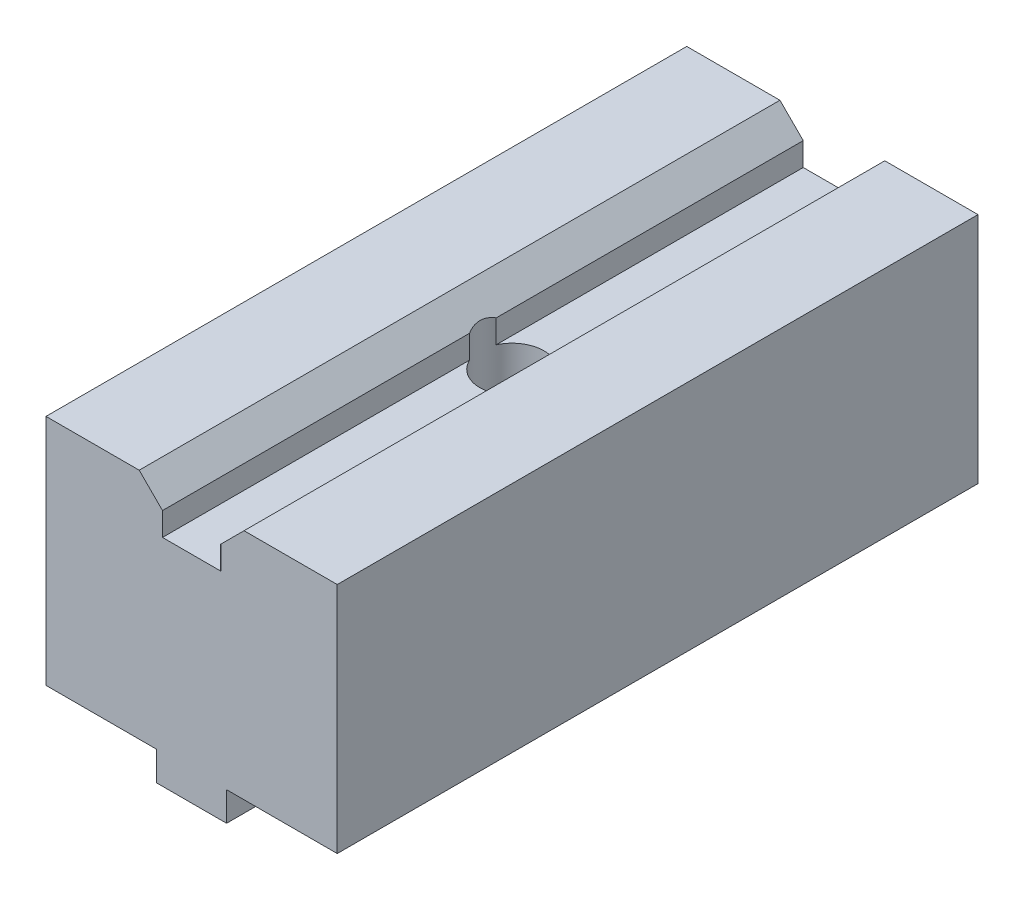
ISO-10303-21;
HEADER;
FILE_DESCRIPTION(('STEP AP214'),'2;1');
FILE_NAME('part.step','',(''),(''),'','','');
FILE_SCHEMA(('AUTOMOTIVE_DESIGN { 1 0 10303 214 1 1 1 1 }'));
ENDSEC;
DATA;
#1=APPLICATION_CONTEXT('core data for automotive mechanical design processes');
#2=APPLICATION_PROTOCOL_DEFINITION('international standard','automotive_design',2000,#1);
#3=PRODUCT_CONTEXT('',#1,'mechanical');
#4=PRODUCT('Part','Part','',(#3));
#5=PRODUCT_RELATED_PRODUCT_CATEGORY('part','',(#4));
#6=PRODUCT_DEFINITION_FORMATION('','',#4);
#7=PRODUCT_DEFINITION_CONTEXT('part definition',#1,'design');
#8=PRODUCT_DEFINITION('design','',#6,#7);
#9=PRODUCT_DEFINITION_SHAPE('','',#8);
#10=(LENGTH_UNIT() NAMED_UNIT(*) SI_UNIT(.MILLI.,.METRE.));
#11=(NAMED_UNIT(*) PLANE_ANGLE_UNIT() SI_UNIT($,.RADIAN.));
#12=(NAMED_UNIT(*) SI_UNIT($,.STERADIAN.) SOLID_ANGLE_UNIT());
#13=UNCERTAINTY_MEASURE_WITH_UNIT(LENGTH_MEASURE(1.E-05),#10,'distance_accuracy_value','');
#14=(GEOMETRIC_REPRESENTATION_CONTEXT(3) GLOBAL_UNCERTAINTY_ASSIGNED_CONTEXT((#13)) GLOBAL_UNIT_ASSIGNED_CONTEXT((#10,
#11,#12)) REPRESENTATION_CONTEXT('',''));
#15=CARTESIAN_POINT('',(0.,0.,0.));
#16=DIRECTION('',(0.,0.,1.));
#17=DIRECTION('',(1.,0.,0.));
#18=AXIS2_PLACEMENT_3D('',#15,#16,#17);
#19=CARTESIAN_POINT('',(2.5,4.53219844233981,27.5));
#20=DIRECTION('',(1.,0.,0.));
#21=DIRECTION('',(0.,1.,0.));
#22=AXIS2_PLACEMENT_3D('',#19,#20,#21);
#23=PLANE('',#22);
#24=DIRECTION('',(0.,0.,-1.));
#25=VECTOR('',#24,1.);
#26=CARTESIAN_POINT('',(2.5,2.53219844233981,27.5));
#27=LINE('',#26,#25);
#28=CARTESIAN_POINT('',(2.5,2.53219844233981,-1.14564392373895));
#29=VERTEX_POINT('',#28);
#30=CARTESIAN_POINT('',(2.5,2.53219844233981,-27.5));
#31=VERTEX_POINT('',#30);
#32=EDGE_CURVE('E406',#29,#31,#27,.T.);
#33=ORIENTED_EDGE('',*,*,#32,.F.);
#34=DIRECTION('',(0.,1.,0.));
#35=VECTOR('',#34,1.);
#36=CARTESIAN_POINT('',(2.5,6.53219844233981,-1.14564392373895));
#37=LINE('',#36,#35);
#38=CARTESIAN_POINT('',(2.5,4.53219844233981,-1.14564392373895));
#39=VERTEX_POINT('',#38);
#40=EDGE_CURVE('E176',#29,#39,#37,.T.);
#41=ORIENTED_EDGE('',*,*,#40,.T.);
#42=DIRECTION('',(0.,0.,-1.));
#43=VECTOR('',#42,1.);
#44=CARTESIAN_POINT('',(2.5,4.53219844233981,27.5));
#45=LINE('',#44,#43);
#46=CARTESIAN_POINT('',(2.5,4.53219844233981,-27.5));
#47=VERTEX_POINT('',#46);
#48=EDGE_CURVE('E412',#39,#47,#45,.T.);
#49=ORIENTED_EDGE('',*,*,#48,.T.);
#50=DIRECTION('',(0.,-1.,0.));
#51=VECTOR('',#50,1.);
#52=CARTESIAN_POINT('',(2.5,4.53219844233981,-27.5));
#53=LINE('',#52,#51);
#54=EDGE_CURVE('E384',#47,#31,#53,.T.);
#55=ORIENTED_EDGE('',*,*,#54,.T.);
#56=EDGE_LOOP('',(#33,#41,#49,#55));
#57=FACE_BOUND('',#56,.T.);
#58=ADVANCED_FACE('F39',(#57),#23,.F.);
#59=CARTESIAN_POINT('',(-2.5,2.53219844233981,27.5));
#60=DIRECTION('',(0.,-1.,0.));
#61=DIRECTION('',(0.,0.,-1.));
#62=AXIS2_PLACEMENT_3D('',#59,#60,#61);
#63=PLANE('',#62);
#64=CARTESIAN_POINT('',(2.5,2.53219844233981,27.5));
#65=VERTEX_POINT('',#64);
#66=CARTESIAN_POINT('',(2.5,2.53219844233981,1.14564392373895));
#67=VERTEX_POINT('',#66);
#68=EDGE_CURVE('E407',#65,#67,#27,.T.);
#69=ORIENTED_EDGE('',*,*,#68,.T.);
#70=CARTESIAN_POINT('',(0.,2.53219844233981,0.));
#71=DIRECTION('',(0.,-1.,0.));
#72=DIRECTION('',(0.,0.,-1.));
#73=AXIS2_PLACEMENT_3D('',#70,#71,#72);
#74=CIRCLE('',#73,2.75);
#75=CARTESIAN_POINT('',(-2.5,2.53219844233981,1.14564392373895));
#76=VERTEX_POINT('',#75);
#77=EDGE_CURVE('E212',#67,#76,#74,.T.);
#78=ORIENTED_EDGE('',*,*,#77,.T.);
#79=DIRECTION('',(0.,0.,-1.));
#80=VECTOR('',#79,1.);
#81=CARTESIAN_POINT('',(-2.5,2.53219844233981,27.5));
#82=LINE('',#81,#80);
#83=CARTESIAN_POINT('',(-2.5,2.53219844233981,27.5));
#84=VERTEX_POINT('',#83);
#85=EDGE_CURVE('E175',#84,#76,#82,.T.);
#86=ORIENTED_EDGE('',*,*,#85,.F.);
#87=DIRECTION('',(-1.,0.,0.));
#88=VECTOR('',#87,1.);
#89=CARTESIAN_POINT('',(-2.5,2.53219844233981,27.5));
#90=LINE('',#89,#88);
#91=EDGE_CURVE('E368',#65,#84,#90,.T.);
#92=ORIENTED_EDGE('',*,*,#91,.F.);
#93=EDGE_LOOP('',(#69,#78,#86,#92));
#94=FACE_BOUND('',#93,.T.);
#95=ADVANCED_FACE('F405',(#94),#63,.F.);
#96=CARTESIAN_POINT('',(-2.5,4.53219844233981,27.5));
#97=DIRECTION('',(-1.,0.,0.));
#98=DIRECTION('',(0.,-1.,0.));
#99=AXIS2_PLACEMENT_3D('',#96,#97,#98);
#100=PLANE('',#99);
#101=ORIENTED_EDGE('',*,*,#85,.T.);
#102=DIRECTION('',(0.,1.,0.));
#103=VECTOR('',#102,1.);
#104=CARTESIAN_POINT('',(-2.5,6.53219844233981,1.14564392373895));
#105=LINE('',#104,#103);
#106=CARTESIAN_POINT('',(-2.5,4.53219844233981,1.14564392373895));
#107=VERTEX_POINT('',#106);
#108=EDGE_CURVE('E162',#76,#107,#105,.T.);
#109=ORIENTED_EDGE('',*,*,#108,.T.);
#110=DIRECTION('',(0.,0.,-1.));
#111=VECTOR('',#110,1.);
#112=CARTESIAN_POINT('',(-2.5,4.53219844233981,27.5));
#113=LINE('',#112,#111);
#114=CARTESIAN_POINT('',(-2.5,4.53219844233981,27.5));
#115=VERTEX_POINT('',#114);
#116=EDGE_CURVE('E172',#115,#107,#113,.T.);
#117=ORIENTED_EDGE('',*,*,#116,.F.);
#118=DIRECTION('',(0.,1.,0.));
#119=VECTOR('',#118,1.);
#120=CARTESIAN_POINT('',(-2.5,4.53219844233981,27.5));
#121=LINE('',#120,#119);
#122=EDGE_CURVE('E372',#84,#115,#121,.T.);
#123=ORIENTED_EDGE('',*,*,#122,.F.);
#124=EDGE_LOOP('',(#101,#109,#117,#123));
#125=FACE_BOUND('',#124,.T.);
#126=ADVANCED_FACE('F170',(#125),#100,.F.);
#127=CARTESIAN_POINT('',(12.5,-13.4678015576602,27.5));
#128=DIRECTION('',(0.,1.,0.));
#129=DIRECTION('',(0.,0.,1.));
#130=AXIS2_PLACEMENT_3D('',#127,#128,#129);
#131=PLANE('',#130);
#132=DIRECTION('',(0.,0.,1.));
#133=VECTOR('',#132,1.);
#134=CARTESIAN_POINT('',(3.,-13.4678015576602,-27.5));
#135=LINE('',#134,#133);
#136=CARTESIAN_POINT('',(3.,-13.4678015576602,-27.5));
#137=VERTEX_POINT('',#136);
#138=CARTESIAN_POINT('',(3.,-13.4678015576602,27.5));
#139=VERTEX_POINT('',#138);
#140=EDGE_CURVE('E273',#137,#139,#135,.T.);
#141=ORIENTED_EDGE('',*,*,#140,.F.);
#142=DIRECTION('',(1.,0.,0.));
#143=VECTOR('',#142,1.);
#144=CARTESIAN_POINT('',(12.5,-13.4678015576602,-27.5));
#145=LINE('',#144,#143);
#146=CARTESIAN_POINT('',(12.5,-13.4678015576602,-27.5));
#147=VERTEX_POINT('',#146);
#148=EDGE_CURVE('E250',#137,#147,#145,.T.);
#149=ORIENTED_EDGE('',*,*,#148,.T.);
#150=DIRECTION('',(0.,0.,-1.));
#151=VECTOR('',#150,1.);
#152=CARTESIAN_POINT('',(12.5,-13.4678015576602,27.5));
#153=LINE('',#152,#151);
#154=CARTESIAN_POINT('',(12.5,-13.4678015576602,27.5));
#155=VERTEX_POINT('',#154);
#156=EDGE_CURVE('E263',#155,#147,#153,.T.);
#157=ORIENTED_EDGE('',*,*,#156,.F.);
#158=DIRECTION('',(1.,0.,0.));
#159=VECTOR('',#158,1.);
#160=CARTESIAN_POINT('',(12.5,-13.4678015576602,27.5));
#161=LINE('',#160,#159);
#162=EDGE_CURVE('E317',#139,#155,#161,.T.);
#163=ORIENTED_EDGE('',*,*,#162,.F.);
#164=EDGE_LOOP('',(#141,#149,#157,#163));
#165=FACE_BOUND('',#164,.T.);
#166=ADVANCED_FACE('F348',(#165),#131,.F.);
#167=CARTESIAN_POINT('',(-12.5,-13.4678015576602,27.5));
#168=DIRECTION('',(1.,0.,0.));
#169=DIRECTION('',(0.,1.,0.));
#170=AXIS2_PLACEMENT_3D('',#167,#168,#169);
#171=PLANE('',#170);
#172=DIRECTION('',(0.,-1.,0.));
#173=VECTOR('',#172,1.);
#174=CARTESIAN_POINT('',(-12.5,-13.4678015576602,-27.5));
#175=LINE('',#174,#173);
#176=CARTESIAN_POINT('',(-12.5,6.53219844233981,-27.5));
#177=VERTEX_POINT('',#176);
#178=CARTESIAN_POINT('',(-12.5,-13.4678015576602,-27.5));
#179=VERTEX_POINT('',#178);
#180=EDGE_CURVE('E243',#177,#179,#175,.T.);
#181=ORIENTED_EDGE('',*,*,#180,.T.);
#182=DIRECTION('',(0.,0.,-1.));
#183=VECTOR('',#182,1.);
#184=CARTESIAN_POINT('',(-12.5,-13.4678015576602,27.5));
#185=LINE('',#184,#183);
#186=CARTESIAN_POINT('',(-12.5,-13.4678015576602,27.5));
#187=VERTEX_POINT('',#186);
#188=EDGE_CURVE('E47',#187,#179,#185,.T.);
#189=ORIENTED_EDGE('',*,*,#188,.F.);
#190=DIRECTION('',(0.,-1.,0.));
#191=VECTOR('',#190,1.);
#192=CARTESIAN_POINT('',(-12.5,-13.4678015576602,27.5));
#193=LINE('',#192,#191);
#194=CARTESIAN_POINT('',(-12.5,6.53219844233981,27.5));
#195=VERTEX_POINT('',#194);
#196=EDGE_CURVE('E324',#195,#187,#193,.T.);
#197=ORIENTED_EDGE('',*,*,#196,.F.);
#198=DIRECTION('',(0.,0.,-1.));
#199=VECTOR('',#198,1.);
#200=CARTESIAN_POINT('',(-12.5,6.53219844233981,27.5));
#201=LINE('',#200,#199);
#202=EDGE_CURVE('E390',#195,#177,#201,.T.);
#203=ORIENTED_EDGE('',*,*,#202,.T.);
#204=EDGE_LOOP('',(#181,#189,#197,#203));
#205=FACE_BOUND('',#204,.T.);
#206=ADVANCED_FACE('F41',(#205),#171,.F.);
#207=CARTESIAN_POINT('',(-3.,-13.4678015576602,-27.5));
#208=VERTEX_POINT('',#207);
#209=EDGE_CURVE('E255',#179,#208,#145,.T.);
#210=ORIENTED_EDGE('',*,*,#209,.T.);
#211=DIRECTION('',(0.,0.,1.));
#212=VECTOR('',#211,1.);
#213=CARTESIAN_POINT('',(-3.,-13.4678015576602,-27.5));
#214=LINE('',#213,#212);
#215=CARTESIAN_POINT('',(-3.,-13.4678015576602,27.5));
#216=VERTEX_POINT('',#215);
#217=EDGE_CURVE('E280',#208,#216,#214,.T.);
#218=ORIENTED_EDGE('',*,*,#217,.T.);
#219=EDGE_CURVE('E313',#187,#216,#161,.T.);
#220=ORIENTED_EDGE('',*,*,#219,.F.);
#221=ORIENTED_EDGE('',*,*,#188,.T.);
#222=EDGE_LOOP('',(#210,#218,#220,#221));
#223=FACE_BOUND('',#222,.T.);
#224=ADVANCED_FACE('F452',(#223),#131,.F.);
#225=CARTESIAN_POINT('',(12.5,-13.4678015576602,27.5));
#226=DIRECTION('',(-1.,0.,0.));
#227=DIRECTION('',(0.,-1.,0.));
#228=AXIS2_PLACEMENT_3D('',#225,#226,#227);
#229=PLANE('',#228);
#230=DIRECTION('',(0.,1.,0.));
#231=VECTOR('',#230,1.);
#232=CARTESIAN_POINT('',(12.5,-13.4678015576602,-27.5));
#233=LINE('',#232,#231);
#234=CARTESIAN_POINT('',(12.5,6.53219844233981,-27.5));
#235=VERTEX_POINT('',#234);
#236=EDGE_CURVE('E245',#147,#235,#233,.T.);
#237=ORIENTED_EDGE('',*,*,#236,.T.);
#238=DIRECTION('',(0.,0.,-1.));
#239=VECTOR('',#238,1.);
#240=CARTESIAN_POINT('',(12.5,6.53219844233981,27.5));
#241=LINE('',#240,#239);
#242=CARTESIAN_POINT('',(12.5,6.53219844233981,27.5));
#243=VERTEX_POINT('',#242);
#244=EDGE_CURVE('E352',#243,#235,#241,.T.);
#245=ORIENTED_EDGE('',*,*,#244,.F.);
#246=DIRECTION('',(0.,1.,0.));
#247=VECTOR('',#246,1.);
#248=CARTESIAN_POINT('',(12.5,-13.4678015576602,27.5));
#249=LINE('',#248,#247);
#250=EDGE_CURVE('E329',#155,#243,#249,.T.);
#251=ORIENTED_EDGE('',*,*,#250,.F.);
#252=ORIENTED_EDGE('',*,*,#156,.T.);
#253=EDGE_LOOP('',(#237,#245,#251,#252));
#254=FACE_BOUND('',#253,.T.);
#255=ADVANCED_FACE('F353',(#254),#229,.F.);
#256=CARTESIAN_POINT('',(12.5,6.53219844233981,27.5));
#257=DIRECTION('',(0.,-1.,0.));
#258=DIRECTION('',(0.,0.,-1.));
#259=AXIS2_PLACEMENT_3D('',#256,#257,#258);
#260=PLANE('',#259);
#261=DIRECTION('',(-1.,0.,0.));
#262=VECTOR('',#261,1.);
#263=CARTESIAN_POINT('',(12.5,6.53219844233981,-27.5));
#264=LINE('',#263,#262);
#265=CARTESIAN_POINT('',(4.50000000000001,6.53219844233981,-27.5));
#266=VERTEX_POINT('',#265);
#267=EDGE_CURVE('E430',#235,#266,#264,.T.);
#268=ORIENTED_EDGE('',*,*,#267,.T.);
#269=DIRECTION('',(0.,0.,-1.));
#270=VECTOR('',#269,1.);
#271=CARTESIAN_POINT('',(4.50000000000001,6.53219844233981,27.5));
#272=LINE('',#271,#270);
#273=CARTESIAN_POINT('',(4.50000000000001,6.53219844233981,27.5));
#274=VERTEX_POINT('',#273);
#275=EDGE_CURVE('E358',#274,#266,#272,.T.);
#276=ORIENTED_EDGE('',*,*,#275,.F.);
#277=DIRECTION('',(-1.,0.,0.));
#278=VECTOR('',#277,1.);
#279=CARTESIAN_POINT('',(12.5,6.53219844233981,27.5));
#280=LINE('',#279,#278);
#281=EDGE_CURVE('E336',#243,#274,#280,.T.);
#282=ORIENTED_EDGE('',*,*,#281,.F.);
#283=ORIENTED_EDGE('',*,*,#244,.T.);
#284=EDGE_LOOP('',(#268,#276,#282,#283));
#285=FACE_BOUND('',#284,.T.);
#286=ADVANCED_FACE('F360',(#285),#260,.F.);
#287=CARTESIAN_POINT('',(4.50000000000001,6.53219844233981,27.5));
#288=DIRECTION('',(0.707106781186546,-0.707106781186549,0.));
#289=DIRECTION('',(0.707106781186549,0.707106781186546,0.));
#290=AXIS2_PLACEMENT_3D('',#287,#288,#289);
#291=PLANE('',#290);
#292=ORIENTED_EDGE('',*,*,#48,.F.);
#293=CARTESIAN_POINT('',(0.,2.03219844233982,0.));
#294=DIRECTION('',(0.707106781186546,-0.707106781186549,0.));
#295=DIRECTION('',(0.707106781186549,0.707106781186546,0.));
#296=AXIS2_PLACEMENT_3D('',#293,#294,#295);
#297=ELLIPSE('',#296,3.889087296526,2.75);
#298=CARTESIAN_POINT('',(2.5,4.53219844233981,1.14564392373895));
#299=VERTEX_POINT('',#298);
#300=EDGE_CURVE('E219',#39,#299,#297,.T.);
#301=ORIENTED_EDGE('',*,*,#300,.T.);
#302=CARTESIAN_POINT('',(2.5,4.53219844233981,27.5));
#303=VERTEX_POINT('',#302);
#304=EDGE_CURVE('E414',#303,#299,#45,.T.);
#305=ORIENTED_EDGE('',*,*,#304,.F.);
#306=DIRECTION('',(-0.707106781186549,-0.707106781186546,0.));
#307=VECTOR('',#306,1.);
#308=CARTESIAN_POINT('',(4.50000000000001,6.53219844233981,27.5));
#309=LINE('',#308,#307);
#310=EDGE_CURVE('E363',#274,#303,#309,.T.);
#311=ORIENTED_EDGE('',*,*,#310,.F.);
#312=ORIENTED_EDGE('',*,*,#275,.T.);
#313=DIRECTION('',(-0.707106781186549,-0.707106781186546,0.));
#314=VECTOR('',#313,1.);
#315=CARTESIAN_POINT('',(4.50000000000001,6.53219844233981,-27.5));
#316=LINE('',#315,#314);
#317=EDGE_CURVE('E424',#266,#47,#316,.T.);
#318=ORIENTED_EDGE('',*,*,#317,.T.);
#319=EDGE_LOOP('',(#292,#301,#305,#311,#312,#318));
#320=FACE_BOUND('',#319,.T.);
#321=ADVANCED_FACE('F423',(#320),#291,.F.);
#322=ORIENTED_EDGE('',*,*,#304,.T.);
#323=DIRECTION('',(0.,1.,0.));
#324=VECTOR('',#323,1.);
#325=CARTESIAN_POINT('',(2.5,6.53219844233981,1.14564392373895));
#326=LINE('',#325,#324);
#327=EDGE_CURVE('E216',#299,#67,#326,.F.);
#328=ORIENTED_EDGE('',*,*,#327,.T.);
#329=ORIENTED_EDGE('',*,*,#68,.F.);
#330=DIRECTION('',(0.,-1.,0.));
#331=VECTOR('',#330,1.);
#332=CARTESIAN_POINT('',(2.5,4.53219844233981,27.5));
#333=LINE('',#332,#331);
#334=EDGE_CURVE('E364',#303,#65,#333,.T.);
#335=ORIENTED_EDGE('',*,*,#334,.F.);
#336=EDGE_LOOP('',(#322,#328,#329,#335));
#337=FACE_BOUND('',#336,.T.);
#338=ADVANCED_FACE('F506',(#337),#23,.F.);
#339=CARTESIAN_POINT('',(-2.5,2.53219844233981,-1.14564392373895));
#340=VERTEX_POINT('',#339);
#341=CARTESIAN_POINT('',(-2.5,2.53219844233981,-27.5));
#342=VERTEX_POINT('',#341);
#343=EDGE_CURVE('E182',#340,#342,#82,.T.);
#344=ORIENTED_EDGE('',*,*,#343,.F.);
#345=EDGE_CURVE('E177',#340,#29,#74,.T.);
#346=ORIENTED_EDGE('',*,*,#345,.T.);
#347=ORIENTED_EDGE('',*,*,#32,.T.);
#348=DIRECTION('',(-1.,0.,0.));
#349=VECTOR('',#348,1.);
#350=CARTESIAN_POINT('',(-2.5,2.53219844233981,-27.5));
#351=LINE('',#350,#349);
#352=EDGE_CURVE('E377',#31,#342,#351,.T.);
#353=ORIENTED_EDGE('',*,*,#352,.T.);
#354=EDGE_LOOP('',(#344,#346,#347,#353));
#355=FACE_BOUND('',#354,.T.);
#356=ADVANCED_FACE('F436',(#355),#63,.F.);
#357=CARTESIAN_POINT('',(-2.5,4.53219844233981,-1.14564392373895));
#358=VERTEX_POINT('',#357);
#359=CARTESIAN_POINT('',(-2.5,4.53219844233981,-27.5));
#360=VERTEX_POINT('',#359);
#361=EDGE_CURVE('E183',#358,#360,#113,.T.);
#362=ORIENTED_EDGE('',*,*,#361,.F.);
#363=DIRECTION('',(0.,1.,0.));
#364=VECTOR('',#363,1.);
#365=CARTESIAN_POINT('',(-2.5,6.53219844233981,-1.14564392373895));
#366=LINE('',#365,#364);
#367=EDGE_CURVE('E54',#358,#340,#366,.F.);
#368=ORIENTED_EDGE('',*,*,#367,.T.);
#369=ORIENTED_EDGE('',*,*,#343,.T.);
#370=DIRECTION('',(0.,1.,0.));
#371=VECTOR('',#370,1.);
#372=CARTESIAN_POINT('',(-2.5,4.53219844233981,-27.5));
#373=LINE('',#372,#371);
#374=EDGE_CURVE('E383',#342,#360,#373,.T.);
#375=ORIENTED_EDGE('',*,*,#374,.T.);
#376=EDGE_LOOP('',(#362,#368,#369,#375));
#377=FACE_BOUND('',#376,.T.);
#378=ADVANCED_FACE('F438',(#377),#100,.F.);
#379=CARTESIAN_POINT('',(-4.50000000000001,6.53219844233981,27.5));
#380=DIRECTION('',(-0.707106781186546,-0.707106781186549,0.));
#381=DIRECTION('',(0.707106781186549,-0.707106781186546,0.));
#382=AXIS2_PLACEMENT_3D('',#379,#380,#381);
#383=PLANE('',#382);
#384=ORIENTED_EDGE('',*,*,#116,.T.);
#385=CARTESIAN_POINT('',(0.,2.03219844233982,0.));
#386=DIRECTION('',(-0.707106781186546,-0.707106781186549,0.));
#387=DIRECTION('',(-0.707106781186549,0.707106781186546,0.));
#388=AXIS2_PLACEMENT_3D('',#385,#386,#387);
#389=ELLIPSE('',#388,3.889087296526,2.75);
#390=EDGE_CURVE('E12',#107,#358,#389,.T.);
#391=ORIENTED_EDGE('',*,*,#390,.T.);
#392=ORIENTED_EDGE('',*,*,#361,.T.);
#393=DIRECTION('',(-0.707106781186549,0.707106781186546,0.));
#394=VECTOR('',#393,1.);
#395=CARTESIAN_POINT('',(-4.50000000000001,6.53219844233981,-27.5));
#396=LINE('',#395,#394);
#397=CARTESIAN_POINT('',(-4.50000000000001,6.53219844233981,-27.5));
#398=VERTEX_POINT('',#397);
#399=EDGE_CURVE('E388',#360,#398,#396,.T.);
#400=ORIENTED_EDGE('',*,*,#399,.T.);
#401=DIRECTION('',(0.,0.,-1.));
#402=VECTOR('',#401,1.);
#403=CARTESIAN_POINT('',(-4.50000000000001,6.53219844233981,27.5));
#404=LINE('',#403,#402);
#405=CARTESIAN_POINT('',(-4.50000000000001,6.53219844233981,27.5));
#406=VERTEX_POINT('',#405);
#407=EDGE_CURVE('E187',#406,#398,#404,.T.);
#408=ORIENTED_EDGE('',*,*,#407,.F.);
#409=DIRECTION('',(-0.707106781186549,0.707106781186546,0.));
#410=VECTOR('',#409,1.);
#411=CARTESIAN_POINT('',(-4.50000000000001,6.53219844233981,27.5));
#412=LINE('',#411,#410);
#413=EDGE_CURVE('E181',#115,#406,#412,.T.);
#414=ORIENTED_EDGE('',*,*,#413,.F.);
#415=EDGE_LOOP('',(#384,#391,#392,#400,#408,#414));
#416=FACE_BOUND('',#415,.T.);
#417=ADVANCED_FACE('F179',(#416),#383,.F.);
#418=CARTESIAN_POINT('',(-12.5,6.53219844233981,27.5));
#419=DIRECTION('',(0.,-1.,0.));
#420=DIRECTION('',(0.,0.,-1.));
#421=AXIS2_PLACEMENT_3D('',#418,#419,#420);
#422=PLANE('',#421);
#423=DIRECTION('',(-1.,0.,0.));
#424=VECTOR('',#423,1.);
#425=CARTESIAN_POINT('',(-12.5,6.53219844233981,-27.5));
#426=LINE('',#425,#424);
#427=EDGE_CURVE('E326',#398,#177,#426,.T.);
#428=ORIENTED_EDGE('',*,*,#427,.T.);
#429=ORIENTED_EDGE('',*,*,#202,.F.);
#430=DIRECTION('',(-1.,0.,0.));
#431=VECTOR('',#430,1.);
#432=CARTESIAN_POINT('',(-12.5,6.53219844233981,27.5));
#433=LINE('',#432,#431);
#434=EDGE_CURVE('E392',#406,#195,#433,.T.);
#435=ORIENTED_EDGE('',*,*,#434,.F.);
#436=ORIENTED_EDGE('',*,*,#407,.T.);
#437=EDGE_LOOP('',(#428,#429,#435,#436));
#438=FACE_BOUND('',#437,.T.);
#439=ADVANCED_FACE('F441',(#438),#422,.F.);
#440=CARTESIAN_POINT('',(0.,0.,27.5));
#441=DIRECTION('',(0.,0.,-1.));
#442=DIRECTION('',(-1.,0.,0.));
#443=AXIS2_PLACEMENT_3D('',#440,#441,#442);
#444=PLANE('',#443);
#445=ORIENTED_EDGE('',*,*,#196,.T.);
#446=ORIENTED_EDGE('',*,*,#219,.T.);
#447=DIRECTION('',(0.,-1.,0.));
#448=VECTOR('',#447,1.);
#449=CARTESIAN_POINT('',(-3.,-13.4678015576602,27.5));
#450=LINE('',#449,#448);
#451=CARTESIAN_POINT('',(-3.,-15.9678015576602,27.5));
#452=VERTEX_POINT('',#451);
#453=EDGE_CURVE('E61',#216,#452,#450,.T.);
#454=ORIENTED_EDGE('',*,*,#453,.T.);
#455=DIRECTION('',(1.,0.,0.));
#456=VECTOR('',#455,1.);
#457=CARTESIAN_POINT('',(-3.,-15.9678015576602,27.5));
#458=LINE('',#457,#456);
#459=CARTESIAN_POINT('',(3.,-15.9678015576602,27.5));
#460=VERTEX_POINT('',#459);
#461=EDGE_CURVE('E229',#452,#460,#458,.T.);
#462=ORIENTED_EDGE('',*,*,#461,.T.);
#463=DIRECTION('',(0.,1.,0.));
#464=VECTOR('',#463,1.);
#465=CARTESIAN_POINT('',(3.,-15.9678015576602,27.5));
#466=LINE('',#465,#464);
#467=EDGE_CURVE('E283',#460,#139,#466,.T.);
#468=ORIENTED_EDGE('',*,*,#467,.T.);
#469=ORIENTED_EDGE('',*,*,#162,.T.);
#470=ORIENTED_EDGE('',*,*,#250,.T.);
#471=ORIENTED_EDGE('',*,*,#281,.T.);
#472=ORIENTED_EDGE('',*,*,#310,.T.);
#473=ORIENTED_EDGE('',*,*,#334,.T.);
#474=ORIENTED_EDGE('',*,*,#91,.T.);
#475=ORIENTED_EDGE('',*,*,#122,.T.);
#476=ORIENTED_EDGE('',*,*,#413,.T.);
#477=ORIENTED_EDGE('',*,*,#434,.T.);
#478=EDGE_LOOP('',(#445,#446,#454,#462,#468,#469,#470,#471,#472,#473,#474,#475,#476,#477));
#479=FACE_BOUND('',#478,.T.);
#480=ADVANCED_FACE('F312',(#479),#444,.F.);
#481=CARTESIAN_POINT('',(0.,0.,-27.5));
#482=DIRECTION('',(0.,0.,-1.));
#483=DIRECTION('',(-1.,0.,0.));
#484=AXIS2_PLACEMENT_3D('',#481,#482,#483);
#485=PLANE('',#484);
#486=ORIENTED_EDGE('',*,*,#180,.F.);
#487=ORIENTED_EDGE('',*,*,#427,.F.);
#488=ORIENTED_EDGE('',*,*,#399,.F.);
#489=ORIENTED_EDGE('',*,*,#374,.F.);
#490=ORIENTED_EDGE('',*,*,#352,.F.);
#491=ORIENTED_EDGE('',*,*,#54,.F.);
#492=ORIENTED_EDGE('',*,*,#317,.F.);
#493=ORIENTED_EDGE('',*,*,#267,.F.);
#494=ORIENTED_EDGE('',*,*,#236,.F.);
#495=ORIENTED_EDGE('',*,*,#148,.F.);
#496=DIRECTION('',(0.,1.,0.));
#497=VECTOR('',#496,1.);
#498=CARTESIAN_POINT('',(3.,-15.9678015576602,-27.5));
#499=LINE('',#498,#497);
#500=CARTESIAN_POINT('',(3.,-15.9678015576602,-27.5));
#501=VERTEX_POINT('',#500);
#502=EDGE_CURVE('E227',#501,#137,#499,.T.);
#503=ORIENTED_EDGE('',*,*,#502,.F.);
#504=DIRECTION('',(1.,0.,0.));
#505=VECTOR('',#504,1.);
#506=CARTESIAN_POINT('',(-3.,-15.9678015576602,-27.5));
#507=LINE('',#506,#505);
#508=CARTESIAN_POINT('',(-3.,-15.9678015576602,-27.5));
#509=VERTEX_POINT('',#508);
#510=EDGE_CURVE('E222',#509,#501,#507,.T.);
#511=ORIENTED_EDGE('',*,*,#510,.F.);
#512=DIRECTION('',(0.,-1.,0.));
#513=VECTOR('',#512,1.);
#514=CARTESIAN_POINT('',(-3.,-13.4678015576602,-27.5));
#515=LINE('',#514,#513);
#516=EDGE_CURVE('E228',#208,#509,#515,.T.);
#517=ORIENTED_EDGE('',*,*,#516,.F.);
#518=ORIENTED_EDGE('',*,*,#209,.F.);
#519=EDGE_LOOP('',(#486,#487,#488,#489,#490,#491,#492,#493,#494,#495,#503,#511,#517,#518));
#520=FACE_BOUND('',#519,.T.);
#521=ADVANCED_FACE('F429',(#520),#485,.T.);
#522=CARTESIAN_POINT('',(3.,-15.9678015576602,-27.5));
#523=DIRECTION('',(1.,0.,0.));
#524=DIRECTION('',(0.,1.,0.));
#525=AXIS2_PLACEMENT_3D('',#522,#523,#524);
#526=PLANE('',#525);
#527=ORIENTED_EDGE('',*,*,#467,.F.);
#528=DIRECTION('',(0.,0.,1.));
#529=VECTOR('',#528,1.);
#530=CARTESIAN_POINT('',(3.,-15.9678015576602,-27.5));
#531=LINE('',#530,#529);
#532=EDGE_CURVE('E269',#501,#460,#531,.T.);
#533=ORIENTED_EDGE('',*,*,#532,.F.);
#534=ORIENTED_EDGE('',*,*,#502,.T.);
#535=ORIENTED_EDGE('',*,*,#140,.T.);
#536=EDGE_LOOP('',(#527,#533,#534,#535));
#537=FACE_BOUND('',#536,.T.);
#538=ADVANCED_FACE('F297',(#537),#526,.T.);
#539=CARTESIAN_POINT('',(-3.,-15.9678015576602,-27.5));
#540=DIRECTION('',(0.,-1.,0.));
#541=DIRECTION('',(0.,0.,-1.));
#542=AXIS2_PLACEMENT_3D('',#539,#540,#541);
#543=PLANE('',#542);
#544=CARTESIAN_POINT('',(0.,-15.9678015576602,0.));
#545=DIRECTION('',(0.,-1.,0.));
#546=DIRECTION('',(0.,0.,-1.));
#547=AXIS2_PLACEMENT_3D('',#544,#545,#546);
#548=CIRCLE('',#547,1.45);
#549=CARTESIAN_POINT('',(0.,-15.9678015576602,-1.45));
#550=VERTEX_POINT('',#549);
#551=EDGE_CURVE('E209',#550,#550,#548,.T.);
#552=ORIENTED_EDGE('',*,*,#551,.F.);
#553=EDGE_LOOP('',(#552));
#554=FACE_BOUND('',#553,.T.);
#555=ORIENTED_EDGE('',*,*,#461,.F.);
#556=DIRECTION('',(0.,0.,1.));
#557=VECTOR('',#556,1.);
#558=CARTESIAN_POINT('',(-3.,-15.9678015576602,-27.5));
#559=LINE('',#558,#557);
#560=EDGE_CURVE('E305',#509,#452,#559,.T.);
#561=ORIENTED_EDGE('',*,*,#560,.F.);
#562=ORIENTED_EDGE('',*,*,#510,.T.);
#563=ORIENTED_EDGE('',*,*,#532,.T.);
#564=EDGE_LOOP('',(#555,#561,#562,#563));
#565=FACE_BOUND('',#564,.T.);
#566=ADVANCED_FACE('F293',(#554,#565),#543,.T.);
#567=CARTESIAN_POINT('',(-3.,-13.4678015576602,-27.5));
#568=DIRECTION('',(-1.,0.,0.));
#569=DIRECTION('',(0.,-1.,0.));
#570=AXIS2_PLACEMENT_3D('',#567,#568,#569);
#571=PLANE('',#570);
#572=ORIENTED_EDGE('',*,*,#453,.F.);
#573=ORIENTED_EDGE('',*,*,#217,.F.);
#574=ORIENTED_EDGE('',*,*,#516,.T.);
#575=ORIENTED_EDGE('',*,*,#560,.T.);
#576=EDGE_LOOP('',(#572,#573,#574,#575));
#577=FACE_BOUND('',#576,.T.);
#578=ADVANCED_FACE('F296',(#577),#571,.T.);
#579=CARTESIAN_POINT('',(0.,6.53219844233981,0.));
#580=DIRECTION('',(0.,1.,0.));
#581=DIRECTION('',(0.,0.,1.));
#582=AXIS2_PLACEMENT_3D('',#579,#580,#581);
#583=CYLINDRICAL_SURFACE('',#582,2.75);
#584=CARTESIAN_POINT('',(0.,-3.46780155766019,0.));
#585=DIRECTION('',(0.,1.,0.));
#586=DIRECTION('',(0.,0.,1.));
#587=AXIS2_PLACEMENT_3D('',#584,#585,#586);
#588=CIRCLE('',#587,2.74999999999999);
#589=CARTESIAN_POINT('',(0.,-3.46780155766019,2.74999999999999));
#590=VERTEX_POINT('',#589);
#591=EDGE_CURVE('E201',#590,#590,#588,.T.);
#592=ORIENTED_EDGE('',*,*,#591,.F.);
#593=EDGE_LOOP('',(#592));
#594=FACE_BOUND('',#593,.T.);
#595=ORIENTED_EDGE('',*,*,#40,.F.);
#596=ORIENTED_EDGE('',*,*,#345,.F.);
#597=ORIENTED_EDGE('',*,*,#367,.F.);
#598=ORIENTED_EDGE('',*,*,#390,.F.);
#599=ORIENTED_EDGE('',*,*,#108,.F.);
#600=ORIENTED_EDGE('',*,*,#77,.F.);
#601=ORIENTED_EDGE('',*,*,#327,.F.);
#602=ORIENTED_EDGE('',*,*,#300,.F.);
#603=EDGE_LOOP('',(#595,#596,#597,#598,#599,#600,#601,#602));
#604=FACE_BOUND('',#603,.T.);
#605=ADVANCED_FACE('F161',(#594,#604),#583,.F.);
#606=CARTESIAN_POINT('',(0.,6.53219844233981,0.));
#607=DIRECTION('',(0.,1.,0.));
#608=DIRECTION('',(0.,0.,1.));
#609=AXIS2_PLACEMENT_3D('',#606,#607,#608);
#610=CYLINDRICAL_SURFACE('',#609,1.45);
#611=ORIENTED_EDGE('',*,*,#551,.T.);
#612=EDGE_LOOP('',(#611));
#613=FACE_BOUND('',#612,.T.);
#614=CARTESIAN_POINT('',(0.,-3.46780155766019,0.));
#615=DIRECTION('',(0.,1.,0.));
#616=DIRECTION('',(0.,0.,1.));
#617=AXIS2_PLACEMENT_3D('',#614,#615,#616);
#618=CIRCLE('',#617,1.45);
#619=CARTESIAN_POINT('',(0.,-3.46780155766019,1.45));
#620=VERTEX_POINT('',#619);
#621=EDGE_CURVE('E206',#620,#620,#618,.T.);
#622=ORIENTED_EDGE('',*,*,#621,.T.);
#623=EDGE_LOOP('',(#622));
#624=FACE_BOUND('',#623,.T.);
#625=ADVANCED_FACE('F290',(#613,#624),#610,.F.);
#626=CARTESIAN_POINT('',(1.45,-3.46780155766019,0.));
#627=DIRECTION('',(0.,-1.,0.));
#628=DIRECTION('',(0.,0.,-1.));
#629=AXIS2_PLACEMENT_3D('',#626,#627,#628);
#630=PLANE('',#629);
#631=ORIENTED_EDGE('',*,*,#621,.F.);
#632=EDGE_LOOP('',(#631));
#633=FACE_BOUND('',#632,.T.);
#634=ORIENTED_EDGE('',*,*,#591,.T.);
#635=EDGE_LOOP('',(#634));
#636=FACE_BOUND('',#635,.T.);
#637=ADVANCED_FACE('F580',(#633,#636),#630,.F.);
#638=CLOSED_SHELL('',(#58,#95,#126,#166,#206,#224,#255,#286,#321,#338,#356,#378,#417,#439,#480,
#521,#538,#566,#578,#605,#625,#637));
#639=MANIFOLD_SOLID_BREP('B2',#638);
#640=ADVANCED_BREP_SHAPE_REPRESENTATION('',(#18,#639),#14);
#641=SHAPE_DEFINITION_REPRESENTATION(#9,#640);
ENDSEC;
END-ISO-10303-21;
